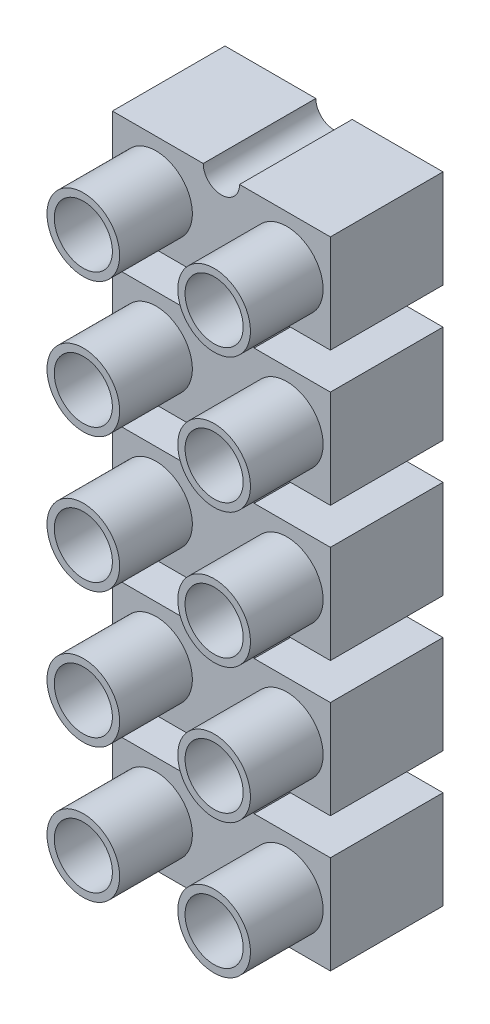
from build123d import *

# Parameters (mm, degrees)
ESQUISSE1_R          = 1.25
BASE_EXTRUSION_DEPTH = 7.75
ESQUISSE2_R          = 2.5
ESQUISSE2_R_2        = 2
BOSS_EXTRU_1_DEPTH   = 5


with BuildPart() as part:
    # Esquisse1 → Base-Extrusion (new body)
    with BuildSketch(Plane.XY):
        with BuildLine():
            Line((-22.504174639, 29.004174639), (-16.254174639, 29.004174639))
            ThreePointArc((-16.254174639, 29.004174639), (-15.004174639, 27.754174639), (-13.754174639, 29.004174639))
            Line((-13.754174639, 29.004174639), (-7.504174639, 29.004174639))
            Line((-7.504174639, 29.004174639), (-7.504174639, 22.254174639))
            Line((-7.504174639, 22.254174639), (-12.754174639, 22.254174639))
            Line((-12.754174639, 22.254174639), (-12.754174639, 19.754174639))
            Line((-12.754174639, 19.754174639), (-7.504174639, 19.754174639))
            Line((-7.504174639, 19.754174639), (-7.504174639, 13.004174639))
            Line((-7.504174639, 13.004174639), (-12.754174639, 13.004174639))
            Line((-12.754174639, 13.004174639), (-12.754174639, 10.504174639))
            Line((-12.754174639, 10.504174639), (-7.504174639, 10.504174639))
            Line((-7.504174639, 10.504174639), (-7.504174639, 3.754174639))
            Line((-7.504174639, 3.754174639), (-12.754174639, 3.754174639))
            Line((-12.754174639, 3.754174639), (-12.754174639, 1.254174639))
            Line((-12.754174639, 1.254174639), (-7.504174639, 1.254174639))
            Line((-7.504174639, 1.254174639), (-7.504174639, -5.495825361))
            Line((-7.504174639, -5.495825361), (-12.754174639, -5.495825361))
            Line((-12.754174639, -5.495825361), (-12.754174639, -7.995825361))
            Line((-12.754174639, -7.995825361), (-7.504174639, -7.995825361))
            Line((-7.504174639, -7.995825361), (-7.504174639, -14.745825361))
            Line((-7.504174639, -14.745825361), (-13.754174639, -14.745825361))
            ThreePointArc((-13.754174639, -14.745825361), (-15.004174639, -13.495825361), (-16.254174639, -14.745825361))
            Line((-16.254174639, -14.745825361), (-22.504174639, -14.745825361))
            Line((-22.504174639, -14.745825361), (-22.504174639, -7.995825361))
            Line((-22.504174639, -7.995825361), (-17.254174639, -7.995825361))
            Line((-17.254174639, -7.995825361), (-17.254174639, -5.495825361))
            Line((-17.254174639, -5.495825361), (-22.504174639, -5.495825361))
            Line((-22.504174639, -5.495825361), (-22.504174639, 1.254174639))
            Line((-22.504174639, 1.254174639), (-17.254174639, 1.254174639))
            Line((-17.254174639, 1.254174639), (-17.254174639, 3.754174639))
            Line((-17.254174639, 3.754174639), (-22.504174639, 3.754174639))
            Line((-22.504174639, 3.754174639), (-22.504174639, 10.504174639))
            Line((-22.504174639, 10.504174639), (-17.254174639, 10.504174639))
            Line((-17.254174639, 10.504174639), (-17.254174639, 13.004174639))
            Line((-17.254174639, 13.004174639), (-22.504174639, 13.004174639))
            Line((-22.504174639, 13.004174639), (-22.504174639, 19.754174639))
            Line((-22.504174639, 19.754174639), (-17.254174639, 19.754174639))
            Line((-17.254174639, 19.754174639), (-17.254174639, 22.254174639))
            Line((-17.254174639, 22.254174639), (-22.504174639, 22.254174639))
            Line((-22.504174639, 22.254174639), (-22.504174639, 29.004174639))
        make_face()
        with Locations((-15.004174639, 21.004174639)):
            Circle(ESQUISSE1_R, mode=Mode.SUBTRACT)
        with Locations((-15.004174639, 11.754174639)):
            Circle(ESQUISSE1_R, mode=Mode.SUBTRACT)
        with Locations((-15.004174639, 2.504174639)):
            Circle(ESQUISSE1_R, mode=Mode.SUBTRACT)
        with Locations((-15.004174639, -6.745825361)):
            Circle(ESQUISSE1_R, mode=Mode.SUBTRACT)
    extrude(amount=BASE_EXTRUSION_DEPTH)

    # Esquisse2 → Boss.-Extru.1 (add)
    # profile 1 of 10: a face of its own
    with BuildSketch(Plane.XY.offset(7.75)):
        with Locations((-10.504174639, 25.634174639)):
            Circle(ESQUISSE2_R)
        with Locations((-10.504174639, 25.634174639)):
            Circle(ESQUISSE2_R_2, mode=Mode.SUBTRACT)
    # profile 2 of 10: a face of its own
    with BuildSketch(Plane.XY.offset(7.75)):
        with Locations(Location((-19.504174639, 25.634174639, 0), (0, 0, 180))):
            Circle(ESQUISSE2_R)
        with Locations(Location((-19.504174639, 25.634174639, 0), (0, 0, 180))):
            Circle(ESQUISSE2_R_2, mode=Mode.SUBTRACT)
    # profile 3 of 10: a face of its own
    with BuildSketch(Plane.XY.offset(7.75)):
        with Locations((-10.504174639, 16.384174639)):
            Circle(ESQUISSE2_R)
        with Locations((-10.504174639, 16.384174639)):
            Circle(ESQUISSE2_R_2, mode=Mode.SUBTRACT)
    # profile 4 of 10: a face of its own
    with BuildSketch(Plane.XY.offset(7.75)):
        with Locations(Location((-19.504174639, 16.384174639, 0), (0, 0, 180))):
            Circle(ESQUISSE2_R)
        with Locations(Location((-19.504174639, 16.384174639, 0), (0, 0, 180))):
            Circle(ESQUISSE2_R_2, mode=Mode.SUBTRACT)
    # profile 5 of 10: a face of its own
    with BuildSketch(Plane.XY.offset(7.75)):
        with Locations((-10.504174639, 7.134174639)):
            Circle(ESQUISSE2_R)
        with Locations((-10.504174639, 7.134174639)):
            Circle(ESQUISSE2_R_2, mode=Mode.SUBTRACT)
    # profile 6 of 10: a face of its own
    with BuildSketch(Plane.XY.offset(7.75)):
        with Locations(Location((-19.504174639, 7.134174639, 0), (0, 0, 180))):
            Circle(ESQUISSE2_R)
        with Locations(Location((-19.504174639, 7.134174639, 0), (0, 0, 180))):
            Circle(ESQUISSE2_R_2, mode=Mode.SUBTRACT)
    # profile 7 of 10: a face of its own
    with BuildSketch(Plane.XY.offset(7.75)):
        with Locations((-10.504174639, -2.115825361)):
            Circle(ESQUISSE2_R)
        with Locations((-10.504174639, -2.115825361)):
            Circle(ESQUISSE2_R_2, mode=Mode.SUBTRACT)
    # profile 8 of 10: a face of its own
    with BuildSketch(Plane.XY.offset(7.75)):
        with Locations(Location((-19.504174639, -2.115825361, 0), (0, 0, 180))):
            Circle(ESQUISSE2_R)
        with Locations(Location((-19.504174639, -2.115825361, 0), (0, 0, 180))):
            Circle(ESQUISSE2_R_2, mode=Mode.SUBTRACT)
    # profile 9 of 10: a face of its own
    with BuildSketch(Plane.XY.offset(7.75)):
        with Locations((-10.504174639, -11.365825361)):
            Circle(ESQUISSE2_R)
        with Locations((-10.504174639, -11.365825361)):
            Circle(ESQUISSE2_R_2, mode=Mode.SUBTRACT)
    # profile 10 of 10: a face of its own
    with BuildSketch(Plane.XY.offset(7.75)):
        with Locations(Location((-19.504174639, -11.365825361, 0), (0, 0, 180))):
            Circle(ESQUISSE2_R)
        with Locations(Location((-19.504174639, -11.365825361, 0), (0, 0, 180))):
            Circle(ESQUISSE2_R_2, mode=Mode.SUBTRACT)
    extrude(amount=BOSS_EXTRU_1_DEPTH)


solid = part.part
